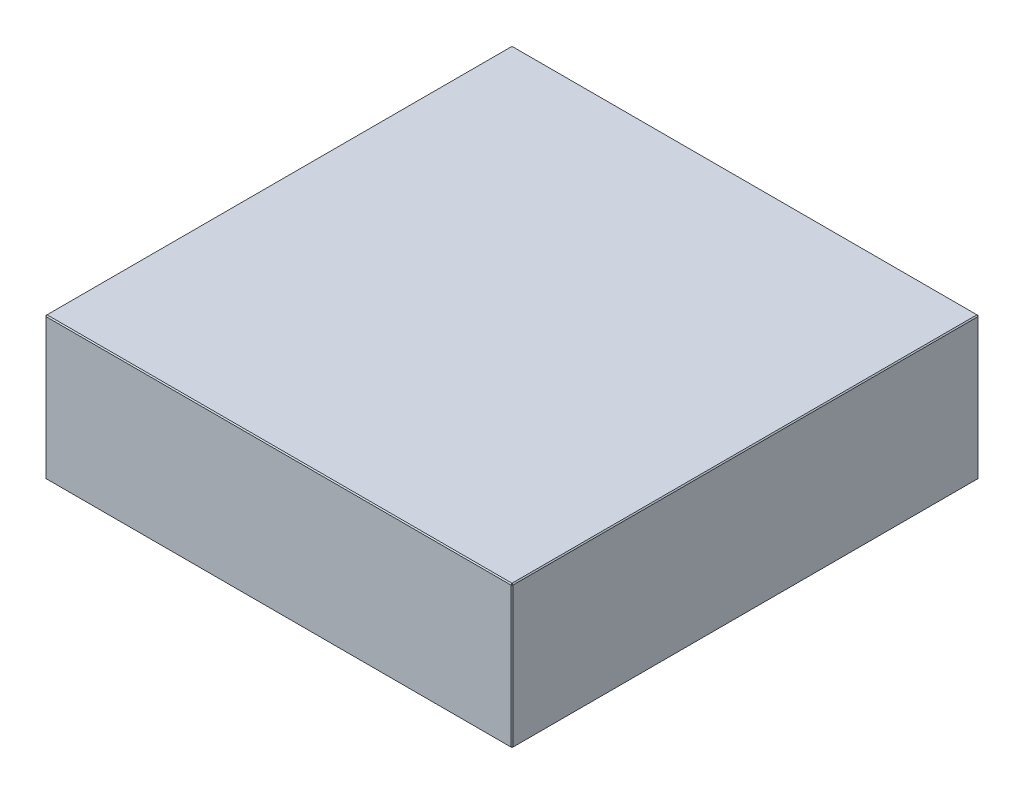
ISO-10303-21;
HEADER;
FILE_DESCRIPTION(('STEP AP214'),'2;1');
FILE_NAME('part.step','',(''),(''),'','','');
FILE_SCHEMA(('AUTOMOTIVE_DESIGN { 1 0 10303 214 1 1 1 1 }'));
ENDSEC;
DATA;
#1=APPLICATION_CONTEXT('core data for automotive mechanical design processes');
#2=APPLICATION_PROTOCOL_DEFINITION('international standard','automotive_design',2000,#1);
#3=PRODUCT_CONTEXT('',#1,'mechanical');
#4=PRODUCT('Part','Part','',(#3));
#5=PRODUCT_RELATED_PRODUCT_CATEGORY('part','',(#4));
#6=PRODUCT_DEFINITION_FORMATION('','',#4);
#7=PRODUCT_DEFINITION_CONTEXT('part definition',#1,'design');
#8=PRODUCT_DEFINITION('design','',#6,#7);
#9=PRODUCT_DEFINITION_SHAPE('','',#8);
#10=(LENGTH_UNIT() NAMED_UNIT(*) SI_UNIT(.MILLI.,.METRE.));
#11=(NAMED_UNIT(*) PLANE_ANGLE_UNIT() SI_UNIT($,.RADIAN.));
#12=(NAMED_UNIT(*) SI_UNIT($,.STERADIAN.) SOLID_ANGLE_UNIT());
#13=UNCERTAINTY_MEASURE_WITH_UNIT(LENGTH_MEASURE(1.E-05),#10,'distance_accuracy_value','');
#14=(GEOMETRIC_REPRESENTATION_CONTEXT(3) GLOBAL_UNCERTAINTY_ASSIGNED_CONTEXT((#13)) GLOBAL_UNIT_ASSIGNED_CONTEXT((#10,
#11,#12)) REPRESENTATION_CONTEXT('',''));
#15=CARTESIAN_POINT('',(0.,0.,0.));
#16=DIRECTION('',(0.,0.,1.));
#17=DIRECTION('',(1.,0.,0.));
#18=AXIS2_PLACEMENT_3D('',#15,#16,#17);
#19=CARTESIAN_POINT('',(-223.,136.,223.));
#20=DIRECTION('',(1.,0.,0.));
#21=DIRECTION('',(0.,0.,-1.));
#22=AXIS2_PLACEMENT_3D('',#19,#20,#21);
#23=PLANE('',#22);
#24=DIRECTION('',(0.,-1.,0.));
#25=VECTOR('',#24,1.);
#26=CARTESIAN_POINT('',(-223.,136.,-222.));
#27=LINE('',#26,#25);
#28=CARTESIAN_POINT('',(-223.,135.,-222.));
#29=VERTEX_POINT('',#28);
#30=CARTESIAN_POINT('',(-223.,0.999999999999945,-222.));
#31=VERTEX_POINT('',#30);
#32=EDGE_CURVE('E114',#29,#31,#27,.T.);
#33=ORIENTED_EDGE('',*,*,#32,.T.);
#34=DIRECTION('',(0.,0.,1.));
#35=VECTOR('',#34,1.);
#36=CARTESIAN_POINT('',(-223.,0.999999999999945,223.));
#37=LINE('',#36,#35);
#38=CARTESIAN_POINT('',(-223.,0.999999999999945,222.));
#39=VERTEX_POINT('',#38);
#40=EDGE_CURVE('E110',#31,#39,#37,.T.);
#41=ORIENTED_EDGE('',*,*,#40,.T.);
#42=DIRECTION('',(0.,1.,0.));
#43=VECTOR('',#42,1.);
#44=CARTESIAN_POINT('',(-223.,136.,222.));
#45=LINE('',#44,#43);
#46=CARTESIAN_POINT('',(-223.,135.,222.));
#47=VERTEX_POINT('',#46);
#48=EDGE_CURVE('E103',#39,#47,#45,.T.);
#49=ORIENTED_EDGE('',*,*,#48,.T.);
#50=DIRECTION('',(0.,0.,-1.));
#51=VECTOR('',#50,1.);
#52=CARTESIAN_POINT('',(-223.,135.,-223.));
#53=LINE('',#52,#51);
#54=EDGE_CURVE('E107',#47,#29,#53,.T.);
#55=ORIENTED_EDGE('',*,*,#54,.T.);
#56=EDGE_LOOP('',(#33,#41,#49,#55));
#57=FACE_BOUND('',#56,.T.);
#58=ADVANCED_FACE('F15',(#57),#23,.F.);
#59=CARTESIAN_POINT('',(223.,136.,223.));
#60=DIRECTION('',(0.,0.,-1.));
#61=DIRECTION('',(-1.,0.,0.));
#62=AXIS2_PLACEMENT_3D('',#59,#60,#61);
#63=PLANE('',#62);
#64=DIRECTION('',(-1.,0.,0.));
#65=VECTOR('',#64,1.);
#66=CARTESIAN_POINT('',(-223.,135.,223.));
#67=LINE('',#66,#65);
#68=CARTESIAN_POINT('',(222.,135.,223.));
#69=VERTEX_POINT('',#68);
#70=CARTESIAN_POINT('',(-222.,135.,223.));
#71=VERTEX_POINT('',#70);
#72=EDGE_CURVE('E164',#69,#71,#67,.T.);
#73=ORIENTED_EDGE('',*,*,#72,.T.);
#74=DIRECTION('',(0.,-1.,0.));
#75=VECTOR('',#74,1.);
#76=CARTESIAN_POINT('',(-222.,136.,223.));
#77=LINE('',#76,#75);
#78=CARTESIAN_POINT('',(-222.,0.999999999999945,223.));
#79=VERTEX_POINT('',#78);
#80=EDGE_CURVE('E122',#71,#79,#77,.T.);
#81=ORIENTED_EDGE('',*,*,#80,.T.);
#82=DIRECTION('',(1.,0.,0.));
#83=VECTOR('',#82,1.);
#84=CARTESIAN_POINT('',(223.,0.999999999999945,223.));
#85=LINE('',#84,#83);
#86=CARTESIAN_POINT('',(222.,0.999999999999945,223.));
#87=VERTEX_POINT('',#86);
#88=EDGE_CURVE('E168',#79,#87,#85,.T.);
#89=ORIENTED_EDGE('',*,*,#88,.T.);
#90=DIRECTION('',(0.,1.,0.));
#91=VECTOR('',#90,1.);
#92=CARTESIAN_POINT('',(222.,136.,223.));
#93=LINE('',#92,#91);
#94=EDGE_CURVE('E166',#87,#69,#93,.T.);
#95=ORIENTED_EDGE('',*,*,#94,.T.);
#96=EDGE_LOOP('',(#73,#81,#89,#95));
#97=FACE_BOUND('',#96,.T.);
#98=ADVANCED_FACE('F275',(#97),#63,.F.);
#99=CARTESIAN_POINT('',(223.,136.,223.));
#100=DIRECTION('',(-1.,0.,0.));
#101=DIRECTION('',(0.,0.,1.));
#102=AXIS2_PLACEMENT_3D('',#99,#100,#101);
#103=PLANE('',#102);
#104=DIRECTION('',(0.,0.,-1.));
#105=VECTOR('',#104,1.);
#106=CARTESIAN_POINT('',(223.,0.999999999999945,223.));
#107=LINE('',#106,#105);
#108=CARTESIAN_POINT('',(223.,0.999999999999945,222.));
#109=VERTEX_POINT('',#108);
#110=CARTESIAN_POINT('',(223.,0.999999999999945,-222.));
#111=VERTEX_POINT('',#110);
#112=EDGE_CURVE('E159',#109,#111,#107,.T.);
#113=ORIENTED_EDGE('',*,*,#112,.T.);
#114=DIRECTION('',(0.,1.,0.));
#115=VECTOR('',#114,1.);
#116=CARTESIAN_POINT('',(223.,136.,-222.));
#117=LINE('',#116,#115);
#118=CARTESIAN_POINT('',(223.,135.,-222.));
#119=VERTEX_POINT('',#118);
#120=EDGE_CURVE('E161',#111,#119,#117,.T.);
#121=ORIENTED_EDGE('',*,*,#120,.T.);
#122=DIRECTION('',(0.,0.,1.));
#123=VECTOR('',#122,1.);
#124=CARTESIAN_POINT('',(223.,135.,223.));
#125=LINE('',#124,#123);
#126=CARTESIAN_POINT('',(223.,135.,222.));
#127=VERTEX_POINT('',#126);
#128=EDGE_CURVE('E155',#119,#127,#125,.T.);
#129=ORIENTED_EDGE('',*,*,#128,.T.);
#130=DIRECTION('',(0.,-1.,0.));
#131=VECTOR('',#130,1.);
#132=CARTESIAN_POINT('',(223.,136.,222.));
#133=LINE('',#132,#131);
#134=EDGE_CURVE('E157',#127,#109,#133,.T.);
#135=ORIENTED_EDGE('',*,*,#134,.T.);
#136=EDGE_LOOP('',(#113,#121,#129,#135));
#137=FACE_BOUND('',#136,.T.);
#138=ADVANCED_FACE('F254',(#137),#103,.F.);
#139=CARTESIAN_POINT('',(223.,136.,-223.));
#140=DIRECTION('',(0.,0.,1.));
#141=DIRECTION('',(1.,0.,0.));
#142=AXIS2_PLACEMENT_3D('',#139,#140,#141);
#143=PLANE('',#142);
#144=DIRECTION('',(0.,-1.,0.));
#145=VECTOR('',#144,1.);
#146=CARTESIAN_POINT('',(222.,136.,-223.));
#147=LINE('',#146,#145);
#148=CARTESIAN_POINT('',(222.,135.,-223.));
#149=VERTEX_POINT('',#148);
#150=CARTESIAN_POINT('',(222.,0.999999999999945,-223.));
#151=VERTEX_POINT('',#150);
#152=EDGE_CURVE('E148',#149,#151,#147,.T.);
#153=ORIENTED_EDGE('',*,*,#152,.T.);
#154=DIRECTION('',(-1.,0.,0.));
#155=VECTOR('',#154,1.);
#156=CARTESIAN_POINT('',(223.,0.999999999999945,-223.));
#157=LINE('',#156,#155);
#158=CARTESIAN_POINT('',(-222.,0.999999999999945,-223.));
#159=VERTEX_POINT('',#158);
#160=EDGE_CURVE('E153',#151,#159,#157,.T.);
#161=ORIENTED_EDGE('',*,*,#160,.T.);
#162=DIRECTION('',(0.,1.,0.));
#163=VECTOR('',#162,1.);
#164=CARTESIAN_POINT('',(-222.,136.,-223.));
#165=LINE('',#164,#163);
#166=CARTESIAN_POINT('',(-222.,135.,-223.));
#167=VERTEX_POINT('',#166);
#168=EDGE_CURVE('E150',#159,#167,#165,.T.);
#169=ORIENTED_EDGE('',*,*,#168,.T.);
#170=DIRECTION('',(1.,0.,0.));
#171=VECTOR('',#170,1.);
#172=CARTESIAN_POINT('',(223.,135.,-223.));
#173=LINE('',#172,#171);
#174=EDGE_CURVE('E146',#167,#149,#173,.T.);
#175=ORIENTED_EDGE('',*,*,#174,.T.);
#176=EDGE_LOOP('',(#153,#161,#169,#175));
#177=FACE_BOUND('',#176,.T.);
#178=ADVANCED_FACE('F284',(#177),#143,.F.);
#179=CARTESIAN_POINT('',(0.,136.,0.));
#180=DIRECTION('',(0.,1.,0.));
#181=DIRECTION('',(0.,0.,1.));
#182=AXIS2_PLACEMENT_3D('',#179,#180,#181);
#183=PLANE('',#182);
#184=DIRECTION('',(0.,0.,-1.));
#185=VECTOR('',#184,1.);
#186=CARTESIAN_POINT('',(222.,136.,-223.));
#187=LINE('',#186,#185);
#188=CARTESIAN_POINT('',(222.,136.,222.));
#189=VERTEX_POINT('',#188);
#190=CARTESIAN_POINT('',(222.,136.,-222.));
#191=VERTEX_POINT('',#190);
#192=EDGE_CURVE('E24',#189,#191,#187,.T.);
#193=ORIENTED_EDGE('',*,*,#192,.T.);
#194=DIRECTION('',(-1.,0.,0.));
#195=VECTOR('',#194,1.);
#196=CARTESIAN_POINT('',(-223.,136.,-222.));
#197=LINE('',#196,#195);
#198=CARTESIAN_POINT('',(-222.,136.,-222.));
#199=VERTEX_POINT('',#198);
#200=EDGE_CURVE('E9',#191,#199,#197,.T.);
#201=ORIENTED_EDGE('',*,*,#200,.T.);
#202=DIRECTION('',(0.,0.,1.));
#203=VECTOR('',#202,1.);
#204=CARTESIAN_POINT('',(-222.,136.,223.));
#205=LINE('',#204,#203);
#206=CARTESIAN_POINT('',(-222.,136.,222.));
#207=VERTEX_POINT('',#206);
#208=EDGE_CURVE('E180',#199,#207,#205,.T.);
#209=ORIENTED_EDGE('',*,*,#208,.T.);
#210=DIRECTION('',(1.,0.,0.));
#211=VECTOR('',#210,1.);
#212=CARTESIAN_POINT('',(223.,136.,222.));
#213=LINE('',#212,#211);
#214=EDGE_CURVE('E35',#207,#189,#213,.T.);
#215=ORIENTED_EDGE('',*,*,#214,.T.);
#216=EDGE_LOOP('',(#193,#201,#209,#215));
#217=FACE_BOUND('',#216,.T.);
#218=ADVANCED_FACE('F350',(#217),#183,.T.);
#219=CARTESIAN_POINT('',(0.,0.,0.));
#220=DIRECTION('',(0.,1.,0.));
#221=DIRECTION('',(0.,0.,1.));
#222=AXIS2_PLACEMENT_3D('',#219,#220,#221);
#223=PLANE('',#222);
#224=DIRECTION('',(0.,0.,1.));
#225=VECTOR('',#224,1.);
#226=CARTESIAN_POINT('',(222.,0.,0.));
#227=LINE('',#226,#225);
#228=CARTESIAN_POINT('',(222.,0.,-222.));
#229=VERTEX_POINT('',#228);
#230=CARTESIAN_POINT('',(222.,0.,222.));
#231=VERTEX_POINT('',#230);
#232=EDGE_CURVE('E171',#229,#231,#227,.T.);
#233=ORIENTED_EDGE('',*,*,#232,.T.);
#234=DIRECTION('',(-1.,0.,0.));
#235=VECTOR('',#234,1.);
#236=CARTESIAN_POINT('',(0.,0.,222.));
#237=LINE('',#236,#235);
#238=CARTESIAN_POINT('',(-222.,0.,222.));
#239=VERTEX_POINT('',#238);
#240=EDGE_CURVE('E177',#231,#239,#237,.T.);
#241=ORIENTED_EDGE('',*,*,#240,.T.);
#242=DIRECTION('',(0.,0.,-1.));
#243=VECTOR('',#242,1.);
#244=CARTESIAN_POINT('',(-222.,0.,0.));
#245=LINE('',#244,#243);
#246=CARTESIAN_POINT('',(-222.,0.,-222.));
#247=VERTEX_POINT('',#246);
#248=EDGE_CURVE('E175',#239,#247,#245,.T.);
#249=ORIENTED_EDGE('',*,*,#248,.T.);
#250=DIRECTION('',(1.,0.,0.));
#251=VECTOR('',#250,1.);
#252=CARTESIAN_POINT('',(0.,0.,-222.));
#253=LINE('',#252,#251);
#254=EDGE_CURVE('E173',#247,#229,#253,.T.);
#255=ORIENTED_EDGE('',*,*,#254,.T.);
#256=EDGE_LOOP('',(#233,#241,#249,#255));
#257=FACE_BOUND('',#256,.T.);
#258=ADVANCED_FACE('F246',(#257),#223,.F.);
#259=CARTESIAN_POINT('',(223.,136.,222.));
#260=DIRECTION('',(-0.707106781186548,0.,-0.707106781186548));
#261=DIRECTION('',(0.,-1.,0.));
#262=AXIS2_PLACEMENT_3D('',#259,#260,#261);
#263=PLANE('',#262);
#264=DIRECTION('',(-0.707106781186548,0.,0.707106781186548));
#265=VECTOR('',#264,1.);
#266=CARTESIAN_POINT('',(222.,135.,223.));
#267=LINE('',#266,#265);
#268=EDGE_CURVE('E19',#69,#127,#267,.F.);
#269=ORIENTED_EDGE('',*,*,#268,.F.);
#270=ORIENTED_EDGE('',*,*,#94,.F.);
#271=DIRECTION('',(0.707106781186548,0.,-0.707106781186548));
#272=VECTOR('',#271,1.);
#273=CARTESIAN_POINT('',(222.,0.999999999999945,223.));
#274=LINE('',#273,#272);
#275=EDGE_CURVE('E142',#109,#87,#274,.F.);
#276=ORIENTED_EDGE('',*,*,#275,.F.);
#277=ORIENTED_EDGE('',*,*,#134,.F.);
#278=EDGE_LOOP('',(#269,#270,#276,#277));
#279=FACE_BOUND('',#278,.T.);
#280=ADVANCED_FACE('F17',(#279),#263,.F.);
#281=CARTESIAN_POINT('',(222.,135.,223.));
#282=DIRECTION('',(0.577350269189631,0.577350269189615,0.577350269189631));
#283=DIRECTION('',(0.707106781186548,0.,-0.707106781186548));
#284=AXIS2_PLACEMENT_3D('',#281,#282,#283);
#285=PLANE('',#284);
#286=DIRECTION('',(0.,-0.707106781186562,0.707106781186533));
#287=VECTOR('',#286,1.);
#288=CARTESIAN_POINT('',(222.,135.,223.));
#289=LINE('',#288,#287);
#290=EDGE_CURVE('E226',#69,#189,#289,.F.);
#291=ORIENTED_EDGE('',*,*,#290,.F.);
#292=ORIENTED_EDGE('',*,*,#268,.T.);
#293=DIRECTION('',(-0.707106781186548,0.707106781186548,0.));
#294=VECTOR('',#293,1.);
#295=CARTESIAN_POINT('',(222.5,135.5,222.));
#296=LINE('',#295,#294);
#297=EDGE_CURVE('E228',#189,#127,#296,.F.);
#298=ORIENTED_EDGE('',*,*,#297,.F.);
#299=EDGE_LOOP('',(#291,#292,#298));
#300=FACE_BOUND('',#299,.T.);
#301=ADVANCED_FACE('F270',(#300),#285,.T.);
#302=CARTESIAN_POINT('',(222.,0.999999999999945,223.));
#303=DIRECTION('',(0.577350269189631,-0.577350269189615,0.577350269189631));
#304=DIRECTION('',(0.707106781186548,0.,-0.707106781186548));
#305=AXIS2_PLACEMENT_3D('',#302,#303,#304);
#306=PLANE('',#305);
#307=DIRECTION('',(-0.707106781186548,-0.707106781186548,0.));
#308=VECTOR('',#307,1.);
#309=CARTESIAN_POINT('',(222.5,0.499999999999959,222.));
#310=LINE('',#309,#308);
#311=EDGE_CURVE('E220',#109,#231,#310,.T.);
#312=ORIENTED_EDGE('',*,*,#311,.F.);
#313=ORIENTED_EDGE('',*,*,#275,.T.);
#314=DIRECTION('',(0.,0.707106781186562,0.707106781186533));
#315=VECTOR('',#314,1.);
#316=CARTESIAN_POINT('',(222.,0.999999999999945,223.));
#317=LINE('',#316,#315);
#318=EDGE_CURVE('E223',#231,#87,#317,.T.);
#319=ORIENTED_EDGE('',*,*,#318,.F.);
#320=EDGE_LOOP('',(#312,#313,#319));
#321=FACE_BOUND('',#320,.T.);
#322=ADVANCED_FACE('F235',(#321),#306,.T.);
#323=CARTESIAN_POINT('',(222.,136.,0.));
#324=DIRECTION('',(0.707106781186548,0.707106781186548,0.));
#325=DIRECTION('',(0.,0.,1.));
#326=AXIS2_PLACEMENT_3D('',#323,#324,#325);
#327=PLANE('',#326);
#328=ORIENTED_EDGE('',*,*,#297,.T.);
#329=ORIENTED_EDGE('',*,*,#128,.F.);
#330=DIRECTION('',(0.707106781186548,-0.707106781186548,0.));
#331=VECTOR('',#330,1.);
#332=CARTESIAN_POINT('',(223.,135.,-222.));
#333=LINE('',#332,#331);
#334=EDGE_CURVE('E215',#191,#119,#333,.T.);
#335=ORIENTED_EDGE('',*,*,#334,.F.);
#336=ORIENTED_EDGE('',*,*,#192,.F.);
#337=EDGE_LOOP('',(#328,#329,#335,#336));
#338=FACE_BOUND('',#337,.T.);
#339=ADVANCED_FACE('F265',(#338),#327,.T.);
#340=CARTESIAN_POINT('',(0.,136.,222.));
#341=DIRECTION('',(0.,0.707106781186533,0.707106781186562));
#342=DIRECTION('',(-1.,0.,0.));
#343=AXIS2_PLACEMENT_3D('',#340,#341,#342);
#344=PLANE('',#343);
#345=ORIENTED_EDGE('',*,*,#290,.T.);
#346=ORIENTED_EDGE('',*,*,#214,.F.);
#347=DIRECTION('',(0.,0.707106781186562,-0.707106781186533));
#348=VECTOR('',#347,1.);
#349=CARTESIAN_POINT('',(-222.,135.5,222.5));
#350=LINE('',#349,#348);
#351=EDGE_CURVE('E126',#71,#207,#350,.T.);
#352=ORIENTED_EDGE('',*,*,#351,.F.);
#353=ORIENTED_EDGE('',*,*,#72,.F.);
#354=EDGE_LOOP('',(#345,#346,#352,#353));
#355=FACE_BOUND('',#354,.T.);
#356=ADVANCED_FACE('F273',(#355),#344,.T.);
#357=CARTESIAN_POINT('',(-222.,136.,223.));
#358=DIRECTION('',(0.707106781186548,0.,-0.707106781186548));
#359=DIRECTION('',(0.,-1.,0.));
#360=AXIS2_PLACEMENT_3D('',#357,#358,#359);
#361=PLANE('',#360);
#362=DIRECTION('',(0.707106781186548,0.,0.707106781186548));
#363=VECTOR('',#362,1.);
#364=CARTESIAN_POINT('',(-222.,0.999999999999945,223.));
#365=LINE('',#364,#363);
#366=EDGE_CURVE('E127',#79,#39,#365,.F.);
#367=ORIENTED_EDGE('',*,*,#366,.F.);
#368=ORIENTED_EDGE('',*,*,#80,.F.);
#369=DIRECTION('',(-0.707106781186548,0.,-0.707106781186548));
#370=VECTOR('',#369,1.);
#371=CARTESIAN_POINT('',(-223.,135.,222.));
#372=LINE('',#371,#370);
#373=EDGE_CURVE('E118',#47,#71,#372,.F.);
#374=ORIENTED_EDGE('',*,*,#373,.F.);
#375=ORIENTED_EDGE('',*,*,#48,.F.);
#376=EDGE_LOOP('',(#367,#368,#374,#375));
#377=FACE_BOUND('',#376,.T.);
#378=ADVANCED_FACE('F120',(#377),#361,.F.);
#379=CARTESIAN_POINT('',(223.,0.999999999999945,223.));
#380=DIRECTION('',(0.,0.707106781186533,-0.707106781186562));
#381=DIRECTION('',(1.,0.,0.));
#382=AXIS2_PLACEMENT_3D('',#379,#380,#381);
#383=PLANE('',#382);
#384=ORIENTED_EDGE('',*,*,#318,.T.);
#385=ORIENTED_EDGE('',*,*,#88,.F.);
#386=DIRECTION('',(0.,-0.707106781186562,-0.707106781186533));
#387=VECTOR('',#386,1.);
#388=CARTESIAN_POINT('',(-222.,0.999999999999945,223.));
#389=LINE('',#388,#387);
#390=EDGE_CURVE('E211',#239,#79,#389,.F.);
#391=ORIENTED_EDGE('',*,*,#390,.F.);
#392=ORIENTED_EDGE('',*,*,#240,.F.);
#393=EDGE_LOOP('',(#384,#385,#391,#392));
#394=FACE_BOUND('',#393,.T.);
#395=ADVANCED_FACE('F243',(#394),#383,.F.);
#396=CARTESIAN_POINT('',(223.,0.999999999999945,223.));
#397=DIRECTION('',(-0.707106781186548,0.707106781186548,0.));
#398=DIRECTION('',(0.,0.,-1.));
#399=AXIS2_PLACEMENT_3D('',#396,#397,#398);
#400=PLANE('',#399);
#401=ORIENTED_EDGE('',*,*,#311,.T.);
#402=ORIENTED_EDGE('',*,*,#232,.F.);
#403=DIRECTION('',(0.707106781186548,0.707106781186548,0.));
#404=VECTOR('',#403,1.);
#405=CARTESIAN_POINT('',(222.5,0.499999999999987,-222.));
#406=LINE('',#405,#404);
#407=EDGE_CURVE('E208',#111,#229,#406,.F.);
#408=ORIENTED_EDGE('',*,*,#407,.F.);
#409=ORIENTED_EDGE('',*,*,#112,.F.);
#410=EDGE_LOOP('',(#401,#402,#408,#409));
#411=FACE_BOUND('',#410,.T.);
#412=ADVANCED_FACE('F251',(#411),#400,.F.);
#413=CARTESIAN_POINT('',(222.,136.,-223.));
#414=DIRECTION('',(-0.707106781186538,0.,0.707106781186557));
#415=DIRECTION('',(0.,-1.,0.));
#416=AXIS2_PLACEMENT_3D('',#413,#414,#415);
#417=PLANE('',#416);
#418=DIRECTION('',(0.707106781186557,0.,0.707106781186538));
#419=VECTOR('',#418,1.);
#420=CARTESIAN_POINT('',(223.,135.,-222.));
#421=LINE('',#420,#419);
#422=EDGE_CURVE('E217',#119,#149,#421,.F.);
#423=ORIENTED_EDGE('',*,*,#422,.F.);
#424=ORIENTED_EDGE('',*,*,#120,.F.);
#425=DIRECTION('',(-0.707106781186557,0.,-0.707106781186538));
#426=VECTOR('',#425,1.);
#427=CARTESIAN_POINT('',(222.,0.999999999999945,-223.));
#428=LINE('',#427,#426);
#429=EDGE_CURVE('E205',#151,#111,#428,.F.);
#430=ORIENTED_EDGE('',*,*,#429,.F.);
#431=ORIENTED_EDGE('',*,*,#152,.F.);
#432=EDGE_LOOP('',(#423,#424,#430,#431));
#433=FACE_BOUND('',#432,.T.);
#434=ADVANCED_FACE('F258',(#433),#417,.F.);
#435=CARTESIAN_POINT('',(223.,135.,-222.));
#436=DIRECTION('',(0.577350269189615,0.577350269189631,-0.577350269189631));
#437=DIRECTION('',(0.,0.707106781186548,0.707106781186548));
#438=AXIS2_PLACEMENT_3D('',#435,#436,#437);
#439=PLANE('',#438);
#440=ORIENTED_EDGE('',*,*,#334,.T.);
#441=ORIENTED_EDGE('',*,*,#422,.T.);
#442=DIRECTION('',(0.,0.707106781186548,0.707106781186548));
#443=VECTOR('',#442,1.);
#444=CARTESIAN_POINT('',(222.,135.5,-222.5));
#445=LINE('',#444,#443);
#446=EDGE_CURVE('E134',#191,#149,#445,.F.);
#447=ORIENTED_EDGE('',*,*,#446,.F.);
#448=EDGE_LOOP('',(#440,#441,#447));
#449=FACE_BOUND('',#448,.T.);
#450=ADVANCED_FACE('F325',(#449),#439,.T.);
#451=CARTESIAN_POINT('',(-223.,135.,222.));
#452=DIRECTION('',(-0.577350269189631,0.577350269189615,0.577350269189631));
#453=DIRECTION('',(0.707106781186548,0.,0.707106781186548));
#454=AXIS2_PLACEMENT_3D('',#451,#452,#453);
#455=PLANE('',#454);
#456=ORIENTED_EDGE('',*,*,#373,.T.);
#457=ORIENTED_EDGE('',*,*,#351,.T.);
#458=DIRECTION('',(-0.707106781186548,-0.707106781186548,0.));
#459=VECTOR('',#458,1.);
#460=CARTESIAN_POINT('',(-223.,135.,222.));
#461=LINE('',#460,#459);
#462=EDGE_CURVE('E130',#47,#207,#461,.F.);
#463=ORIENTED_EDGE('',*,*,#462,.F.);
#464=EDGE_LOOP('',(#456,#457,#463));
#465=FACE_BOUND('',#464,.T.);
#466=ADVANCED_FACE('F131',(#465),#455,.T.);
#467=CARTESIAN_POINT('',(-222.,0.999999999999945,223.));
#468=DIRECTION('',(-0.577350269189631,-0.577350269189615,0.577350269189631));
#469=DIRECTION('',(0.707106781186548,0.,0.707106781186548));
#470=AXIS2_PLACEMENT_3D('',#467,#468,#469);
#471=PLANE('',#470);
#472=ORIENTED_EDGE('',*,*,#390,.T.);
#473=ORIENTED_EDGE('',*,*,#366,.T.);
#474=DIRECTION('',(-0.707106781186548,0.707106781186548,0.));
#475=VECTOR('',#474,1.);
#476=CARTESIAN_POINT('',(-222.5,0.499999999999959,222.));
#477=LINE('',#476,#475);
#478=EDGE_CURVE('E135',#239,#39,#477,.T.);
#479=ORIENTED_EDGE('',*,*,#478,.F.);
#480=EDGE_LOOP('',(#472,#473,#479));
#481=FACE_BOUND('',#480,.T.);
#482=ADVANCED_FACE('F318',(#481),#471,.T.);
#483=CARTESIAN_POINT('',(222.,0.999999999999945,-223.));
#484=DIRECTION('',(0.577350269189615,-0.577350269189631,-0.577350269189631));
#485=DIRECTION('',(0.,0.707106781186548,-0.707106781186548));
#486=AXIS2_PLACEMENT_3D('',#483,#484,#485);
#487=PLANE('',#486);
#488=ORIENTED_EDGE('',*,*,#429,.T.);
#489=ORIENTED_EDGE('',*,*,#407,.T.);
#490=DIRECTION('',(0.,-0.707106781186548,0.707106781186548));
#491=VECTOR('',#490,1.);
#492=CARTESIAN_POINT('',(222.,0.999999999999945,-223.));
#493=LINE('',#492,#491);
#494=EDGE_CURVE('E198',#151,#229,#493,.T.);
#495=ORIENTED_EDGE('',*,*,#494,.F.);
#496=EDGE_LOOP('',(#488,#489,#495));
#497=FACE_BOUND('',#496,.T.);
#498=ADVANCED_FACE('F314',(#497),#487,.T.);
#499=CARTESIAN_POINT('',(0.,136.,-222.));
#500=DIRECTION('',(0.,0.707106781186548,-0.707106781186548));
#501=DIRECTION('',(1.,0.,0.));
#502=AXIS2_PLACEMENT_3D('',#499,#500,#501);
#503=PLANE('',#502);
#504=ORIENTED_EDGE('',*,*,#446,.T.);
#505=ORIENTED_EDGE('',*,*,#174,.F.);
#506=DIRECTION('',(0.,-0.707106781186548,-0.707106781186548));
#507=VECTOR('',#506,1.);
#508=CARTESIAN_POINT('',(-222.,135.,-223.));
#509=LINE('',#508,#507);
#510=EDGE_CURVE('E195',#199,#167,#509,.T.);
#511=ORIENTED_EDGE('',*,*,#510,.F.);
#512=ORIENTED_EDGE('',*,*,#200,.F.);
#513=EDGE_LOOP('',(#504,#505,#511,#512));
#514=FACE_BOUND('',#513,.T.);
#515=ADVANCED_FACE('F311',(#514),#503,.T.);
#516=CARTESIAN_POINT('',(-222.,136.,0.));
#517=DIRECTION('',(-0.707106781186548,0.707106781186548,0.));
#518=DIRECTION('',(0.,0.,-1.));
#519=AXIS2_PLACEMENT_3D('',#516,#517,#518);
#520=PLANE('',#519);
#521=ORIENTED_EDGE('',*,*,#462,.T.);
#522=ORIENTED_EDGE('',*,*,#208,.F.);
#523=DIRECTION('',(0.707106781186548,0.707106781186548,0.));
#524=VECTOR('',#523,1.);
#525=CARTESIAN_POINT('',(-222.5,135.5,-222.));
#526=LINE('',#525,#524);
#527=EDGE_CURVE('E138',#29,#199,#526,.T.);
#528=ORIENTED_EDGE('',*,*,#527,.F.);
#529=ORIENTED_EDGE('',*,*,#54,.F.);
#530=EDGE_LOOP('',(#521,#522,#528,#529));
#531=FACE_BOUND('',#530,.T.);
#532=ADVANCED_FACE('F137',(#531),#520,.T.);
#533=CARTESIAN_POINT('',(-223.,0.999999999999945,223.));
#534=DIRECTION('',(0.707106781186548,0.707106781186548,0.));
#535=DIRECTION('',(0.,0.,1.));
#536=AXIS2_PLACEMENT_3D('',#533,#534,#535);
#537=PLANE('',#536);
#538=ORIENTED_EDGE('',*,*,#478,.T.);
#539=ORIENTED_EDGE('',*,*,#40,.F.);
#540=DIRECTION('',(0.707106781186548,-0.707106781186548,0.));
#541=VECTOR('',#540,1.);
#542=CARTESIAN_POINT('',(-223.,0.999999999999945,-222.));
#543=LINE('',#542,#541);
#544=EDGE_CURVE('E191',#247,#31,#543,.F.);
#545=ORIENTED_EDGE('',*,*,#544,.F.);
#546=ORIENTED_EDGE('',*,*,#248,.F.);
#547=EDGE_LOOP('',(#538,#539,#545,#546));
#548=FACE_BOUND('',#547,.T.);
#549=ADVANCED_FACE('F304',(#548),#537,.F.);
#550=CARTESIAN_POINT('',(223.,0.999999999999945,-223.));
#551=DIRECTION('',(0.,0.707106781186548,0.707106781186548));
#552=DIRECTION('',(-1.,0.,0.));
#553=AXIS2_PLACEMENT_3D('',#550,#551,#552);
#554=PLANE('',#553);
#555=ORIENTED_EDGE('',*,*,#494,.T.);
#556=ORIENTED_EDGE('',*,*,#254,.F.);
#557=DIRECTION('',(0.,0.707106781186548,-0.707106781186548));
#558=VECTOR('',#557,1.);
#559=CARTESIAN_POINT('',(-222.,0.499999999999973,-222.5));
#560=LINE('',#559,#558);
#561=EDGE_CURVE('E188',#159,#247,#560,.F.);
#562=ORIENTED_EDGE('',*,*,#561,.F.);
#563=ORIENTED_EDGE('',*,*,#160,.F.);
#564=EDGE_LOOP('',(#555,#556,#562,#563));
#565=FACE_BOUND('',#564,.T.);
#566=ADVANCED_FACE('F300',(#565),#554,.F.);
#567=CARTESIAN_POINT('',(-222.,135.,-223.));
#568=DIRECTION('',(-0.577350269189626,0.577350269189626,-0.577350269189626));
#569=DIRECTION('',(-0.707106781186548,0.,0.707106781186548));
#570=AXIS2_PLACEMENT_3D('',#567,#568,#569);
#571=PLANE('',#570);
#572=ORIENTED_EDGE('',*,*,#527,.T.);
#573=ORIENTED_EDGE('',*,*,#510,.T.);
#574=DIRECTION('',(0.707106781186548,0.,-0.707106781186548));
#575=VECTOR('',#574,1.);
#576=CARTESIAN_POINT('',(-222.,135.,-223.));
#577=LINE('',#576,#575);
#578=EDGE_CURVE('E186',#29,#167,#577,.T.);
#579=ORIENTED_EDGE('',*,*,#578,.F.);
#580=EDGE_LOOP('',(#572,#573,#579));
#581=FACE_BOUND('',#580,.T.);
#582=ADVANCED_FACE('F296',(#581),#571,.T.);
#583=CARTESIAN_POINT('',(-223.,0.999999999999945,-222.));
#584=DIRECTION('',(-0.577350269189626,-0.577350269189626,-0.577350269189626));
#585=DIRECTION('',(-0.707106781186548,0.,0.707106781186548));
#586=AXIS2_PLACEMENT_3D('',#583,#584,#585);
#587=PLANE('',#586);
#588=ORIENTED_EDGE('',*,*,#561,.T.);
#589=ORIENTED_EDGE('',*,*,#544,.T.);
#590=DIRECTION('',(-0.707106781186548,0.,0.707106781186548));
#591=VECTOR('',#590,1.);
#592=CARTESIAN_POINT('',(-223.,0.999999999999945,-222.));
#593=LINE('',#592,#591);
#594=EDGE_CURVE('E184',#159,#31,#593,.T.);
#595=ORIENTED_EDGE('',*,*,#594,.F.);
#596=EDGE_LOOP('',(#588,#589,#595));
#597=FACE_BOUND('',#596,.T.);
#598=ADVANCED_FACE('F292',(#597),#587,.T.);
#599=CARTESIAN_POINT('',(-223.,136.,-222.));
#600=DIRECTION('',(0.707106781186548,0.,0.707106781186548));
#601=DIRECTION('',(0.,-1.,0.));
#602=AXIS2_PLACEMENT_3D('',#599,#600,#601);
#603=PLANE('',#602);
#604=ORIENTED_EDGE('',*,*,#578,.T.);
#605=ORIENTED_EDGE('',*,*,#168,.F.);
#606=ORIENTED_EDGE('',*,*,#594,.T.);
#607=ORIENTED_EDGE('',*,*,#32,.F.);
#608=EDGE_LOOP('',(#604,#605,#606,#607));
#609=FACE_BOUND('',#608,.T.);
#610=ADVANCED_FACE('F289',(#609),#603,.F.);
#611=CLOSED_SHELL('',(#58,#98,#138,#178,#218,#258,#280,#301,#322,#339,#356,#378,#395,#412,#434,
#450,#466,#482,#498,#515,#532,#549,#566,#582,#598,#610));
#612=MANIFOLD_SOLID_BREP('B1',#611);
#613=ADVANCED_BREP_SHAPE_REPRESENTATION('',(#18,#612),#14);
#614=SHAPE_DEFINITION_REPRESENTATION(#9,#613);
ENDSEC;
END-ISO-10303-21;
